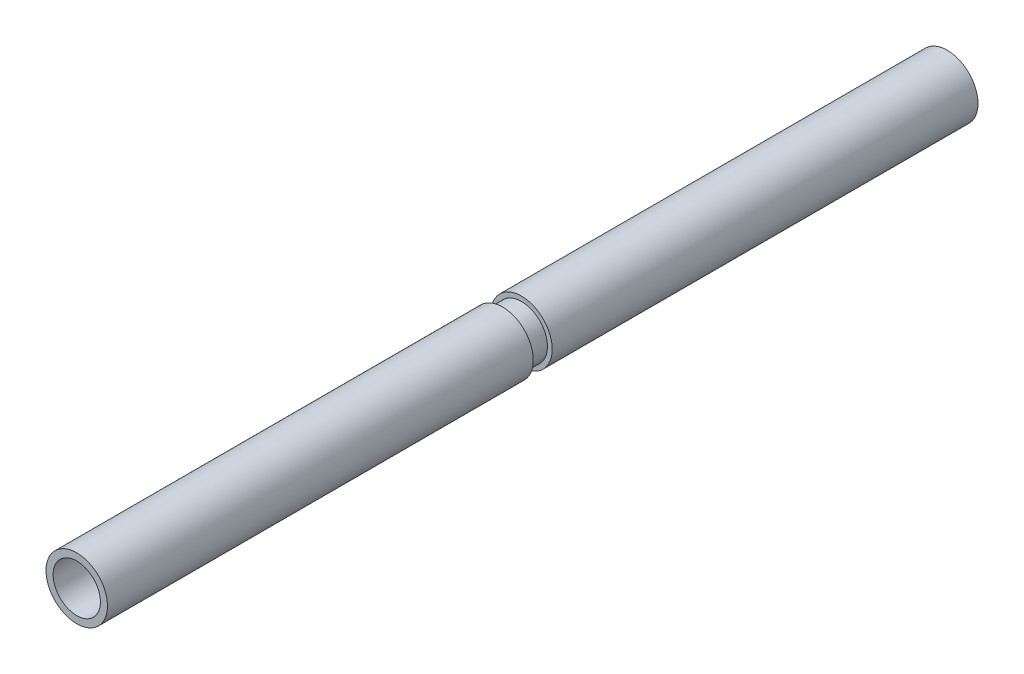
ISO-10303-21;
HEADER;
FILE_DESCRIPTION(('STEP AP214'),'2;1');
FILE_NAME('part.step','',(''),(''),'','','');
FILE_SCHEMA(('AUTOMOTIVE_DESIGN { 1 0 10303 214 1 1 1 1 }'));
ENDSEC;
DATA;
#1=APPLICATION_CONTEXT('core data for automotive mechanical design processes');
#2=APPLICATION_PROTOCOL_DEFINITION('international standard','automotive_design',2000,#1);
#3=PRODUCT_CONTEXT('',#1,'mechanical');
#4=PRODUCT('Part','Part','',(#3));
#5=PRODUCT_RELATED_PRODUCT_CATEGORY('part','',(#4));
#6=PRODUCT_DEFINITION_FORMATION('','',#4);
#7=PRODUCT_DEFINITION_CONTEXT('part definition',#1,'design');
#8=PRODUCT_DEFINITION('design','',#6,#7);
#9=PRODUCT_DEFINITION_SHAPE('','',#8);
#10=(LENGTH_UNIT() NAMED_UNIT(*) SI_UNIT(.MILLI.,.METRE.));
#11=(NAMED_UNIT(*) PLANE_ANGLE_UNIT() SI_UNIT($,.RADIAN.));
#12=(NAMED_UNIT(*) SI_UNIT($,.STERADIAN.) SOLID_ANGLE_UNIT());
#13=UNCERTAINTY_MEASURE_WITH_UNIT(LENGTH_MEASURE(1.E-05),#10,'distance_accuracy_value','');
#14=(GEOMETRIC_REPRESENTATION_CONTEXT(3) GLOBAL_UNCERTAINTY_ASSIGNED_CONTEXT((#13)) GLOBAL_UNIT_ASSIGNED_CONTEXT((#10,
#11,#12)) REPRESENTATION_CONTEXT('',''));
#15=CARTESIAN_POINT('',(0.,0.,0.));
#16=DIRECTION('',(0.,0.,1.));
#17=DIRECTION('',(1.,0.,0.));
#18=AXIS2_PLACEMENT_3D('',#15,#16,#17);
#19=CARTESIAN_POINT('',(0.,0.,90.));
#20=DIRECTION('',(0.,0.,-1.));
#21=DIRECTION('',(-1.,0.,0.));
#22=AXIS2_PLACEMENT_3D('',#19,#20,#21);
#23=CYLINDRICAL_SURFACE('',#22,6.5);
#24=CARTESIAN_POINT('',(0.,0.,90.));
#25=DIRECTION('',(0.,0.,1.));
#26=DIRECTION('',(1.,0.,0.));
#27=AXIS2_PLACEMENT_3D('',#24,#25,#26);
#28=CIRCLE('',#27,6.5);
#29=CARTESIAN_POINT('',(-6.5,0.,90.));
#30=VERTEX_POINT('',#29);
#31=EDGE_CURVE('E38',#30,#30,#28,.T.);
#32=CARTESIAN_POINT('',(0.,0.,0.));
#33=DIRECTION('',(0.,0.,1.));
#34=DIRECTION('',(1.,0.,0.));
#35=AXIS2_PLACEMENT_3D('',#32,#33,#34);
#36=CIRCLE('',#35,6.5);
#37=CARTESIAN_POINT('',(-6.5,0.,0.));
#38=VERTEX_POINT('',#37);
#39=EDGE_CURVE('E34',#38,#38,#36,.T.);
#40=CARTESIAN_POINT('',(-6.5,0.,90.));
#41=CARTESIAN_POINT('',(-6.5,0.,89.0625));
#42=CARTESIAN_POINT('',(-6.5,0.,88.125));
#43=CARTESIAN_POINT('',(-6.5,0.,86.25));
#44=CARTESIAN_POINT('',(-6.5,0.,85.3125));
#45=CARTESIAN_POINT('',(-6.5,0.,83.4375));
#46=CARTESIAN_POINT('',(-6.5,0.,82.5));
#47=CARTESIAN_POINT('',(-6.5,0.,80.625));
#48=CARTESIAN_POINT('',(-6.5,0.,79.6875));
#49=CARTESIAN_POINT('',(-6.5,0.,77.8125));
#50=CARTESIAN_POINT('',(-6.5,0.,76.875));
#51=CARTESIAN_POINT('',(-6.5,0.,75.));
#52=CARTESIAN_POINT('',(-6.5,0.,74.0625));
#53=CARTESIAN_POINT('',(-6.5,0.,72.1875));
#54=CARTESIAN_POINT('',(-6.5,0.,71.25));
#55=CARTESIAN_POINT('',(-6.5,0.,69.375));
#56=CARTESIAN_POINT('',(-6.5,0.,68.4375));
#57=CARTESIAN_POINT('',(-6.5,0.,66.5625));
#58=CARTESIAN_POINT('',(-6.5,0.,65.625));
#59=CARTESIAN_POINT('',(-6.5,0.,63.75));
#60=CARTESIAN_POINT('',(-6.5,0.,62.8125));
#61=CARTESIAN_POINT('',(-6.5,0.,60.9375));
#62=CARTESIAN_POINT('',(-6.5,0.,60.));
#63=CARTESIAN_POINT('',(-6.5,0.,58.125));
#64=CARTESIAN_POINT('',(-6.5,0.,57.1875));
#65=CARTESIAN_POINT('',(-6.5,0.,55.3125));
#66=CARTESIAN_POINT('',(-6.5,0.,54.375));
#67=CARTESIAN_POINT('',(-6.5,0.,52.5));
#68=CARTESIAN_POINT('',(-6.5,0.,51.5625));
#69=CARTESIAN_POINT('',(-6.5,0.,49.6875));
#70=CARTESIAN_POINT('',(-6.5,0.,48.75));
#71=CARTESIAN_POINT('',(-6.5,0.,46.875));
#72=CARTESIAN_POINT('',(-6.5,0.,45.9375));
#73=CARTESIAN_POINT('',(-6.5,0.,44.0625));
#74=CARTESIAN_POINT('',(-6.5,0.,43.125));
#75=CARTESIAN_POINT('',(-6.5,0.,41.25));
#76=CARTESIAN_POINT('',(-6.5,0.,40.3125));
#77=CARTESIAN_POINT('',(-6.5,0.,38.4375));
#78=CARTESIAN_POINT('',(-6.5,0.,37.5));
#79=CARTESIAN_POINT('',(-6.5,0.,35.625));
#80=CARTESIAN_POINT('',(-6.5,0.,34.6875));
#81=CARTESIAN_POINT('',(-6.5,0.,32.8125));
#82=CARTESIAN_POINT('',(-6.5,0.,31.875));
#83=CARTESIAN_POINT('',(-6.5,0.,30.));
#84=CARTESIAN_POINT('',(-6.5,0.,29.0625));
#85=CARTESIAN_POINT('',(-6.5,0.,27.1875));
#86=CARTESIAN_POINT('',(-6.5,0.,26.25));
#87=CARTESIAN_POINT('',(-6.5,0.,24.375));
#88=CARTESIAN_POINT('',(-6.5,0.,23.4375));
#89=CARTESIAN_POINT('',(-6.5,0.,21.5625));
#90=CARTESIAN_POINT('',(-6.5,0.,20.625));
#91=CARTESIAN_POINT('',(-6.5,0.,18.75));
#92=CARTESIAN_POINT('',(-6.5,0.,17.8125));
#93=CARTESIAN_POINT('',(-6.5,0.,15.9375));
#94=CARTESIAN_POINT('',(-6.5,0.,15.));
#95=CARTESIAN_POINT('',(-6.5,0.,13.125));
#96=CARTESIAN_POINT('',(-6.5,0.,12.1875));
#97=CARTESIAN_POINT('',(-6.5,0.,10.3125));
#98=CARTESIAN_POINT('',(-6.5,0.,9.37499999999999));
#99=CARTESIAN_POINT('',(-6.5,0.,7.49999999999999));
#100=CARTESIAN_POINT('',(-6.5,0.,6.56249999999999));
#101=CARTESIAN_POINT('',(-6.5,0.,4.68749999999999));
#102=CARTESIAN_POINT('',(-6.5,0.,3.74999999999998));
#103=CARTESIAN_POINT('',(-6.5,0.,1.87499999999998));
#104=CARTESIAN_POINT('',(-6.5,0.,0.937499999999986));
#105=CARTESIAN_POINT('',(-6.5,0.,0.));
#106=B_SPLINE_CURVE_WITH_KNOTS('',3,(#40,#41,#42,#43,#44,#45,#46,#47,#48,#49,#50,#51,#52,#53,
#54,#55,#56,#57,#58,#59,#60,#61,#62,#63,#64,#65,#66,#67,#68,#69,#70,#71,#72,#73,#74,#75,#76,#77,
#78,#79,#80,#81,#82,#83,#84,#85,#86,#87,#88,#89,#90,#91,#92,#93,#94,#95,#96,#97,#98,#99,#100,
#101,#102,#103,#104,#105),.UNSPECIFIED.,.F.,.F.,(4,2,2,2,2,2,2,2,2,2,2,2,2,2,2,2,2,2,2,2,2,2,2,
2,2,2,2,2,2,2,2,2,4),(0.,2.81250000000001,5.62500000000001,8.43750000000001,11.25,14.0625,
16.875,19.6875,22.5,25.3125,28.125,30.9375,33.75,36.5625,39.375,42.1875,45.,47.8125,50.625,
53.4375,56.25,59.0625,61.875,64.6875,67.5,70.3125,73.125,75.9375,78.75,81.5625,84.375,87.1875,
90.),.UNSPECIFIED.);
#107=EDGE_CURVE('BSEAM31',#30,#38,#106,.T.);
#108=ORIENTED_EDGE('',*,*,#31,.F.);
#109=ORIENTED_EDGE('',*,*,#39,.T.);
#110=ORIENTED_EDGE('',*,*,#107,.T.);
#111=ORIENTED_EDGE('',*,*,#107,.F.);
#112=EDGE_LOOP('',(#108,#110,#109,#111));
#113=FACE_BOUND('',#112,.T.);
#114=ADVANCED_FACE('F31',(#113),#23,.T.);
#115=CARTESIAN_POINT('',(0.,0.,90.));
#116=DIRECTION('',(0.,0.,1.));
#117=DIRECTION('',(1.,0.,0.));
#118=AXIS2_PLACEMENT_3D('',#115,#116,#117);
#119=PLANE('',#118);
#120=CARTESIAN_POINT('',(0.,0.,90.));
#121=DIRECTION('',(0.,0.,1.));
#122=DIRECTION('',(1.,0.,0.));
#123=AXIS2_PLACEMENT_3D('',#120,#121,#122);
#124=CIRCLE('',#123,5.);
#125=CARTESIAN_POINT('',(-5.,0.,90.));
#126=VERTEX_POINT('',#125);
#127=EDGE_CURVE('E56',#126,#126,#124,.T.);
#128=ORIENTED_EDGE('',*,*,#127,.F.);
#129=EDGE_LOOP('',(#128));
#130=FACE_BOUND('',#129,.T.);
#131=ORIENTED_EDGE('',*,*,#31,.T.);
#132=EDGE_LOOP('',(#131));
#133=FACE_BOUND('',#132,.T.);
#134=ADVANCED_FACE('F62',(#130,#133),#119,.T.);
#135=CARTESIAN_POINT('',(0.,0.,0.));
#136=DIRECTION('',(0.,0.,1.));
#137=DIRECTION('',(1.,0.,0.));
#138=AXIS2_PLACEMENT_3D('',#135,#136,#137);
#139=PLANE('',#138);
#140=CARTESIAN_POINT('',(0.,0.,0.));
#141=DIRECTION('',(0.,0.,-1.));
#142=DIRECTION('',(-1.,0.,0.));
#143=AXIS2_PLACEMENT_3D('',#140,#141,#142);
#144=CIRCLE('',#143,5.5);
#145=CARTESIAN_POINT('',(-5.5,0.,0.));
#146=VERTEX_POINT('',#145);
#147=EDGE_CURVE('E10',#146,#146,#144,.T.);
#148=ORIENTED_EDGE('',*,*,#147,.F.);
#149=EDGE_LOOP('',(#148));
#150=FACE_BOUND('',#149,.T.);
#151=ORIENTED_EDGE('',*,*,#39,.F.);
#152=EDGE_LOOP('',(#151));
#153=FACE_BOUND('',#152,.T.);
#154=ADVANCED_FACE('F65',(#150,#153),#139,.F.);
#155=CARTESIAN_POINT('',(0.,0.,-4.));
#156=DIRECTION('',(0.,0.,1.));
#157=DIRECTION('',(1.,0.,0.));
#158=AXIS2_PLACEMENT_3D('',#155,#156,#157);
#159=CYLINDRICAL_SURFACE('',#158,5.5);
#160=CARTESIAN_POINT('',(0.,0.,-4.));
#161=DIRECTION('',(0.,0.,-1.));
#162=DIRECTION('',(-1.,0.,0.));
#163=AXIS2_PLACEMENT_3D('',#160,#161,#162);
#164=CIRCLE('',#163,5.5);
#165=CARTESIAN_POINT('',(-5.5,0.,-4.));
#166=VERTEX_POINT('',#165);
#167=EDGE_CURVE('E44',#166,#166,#164,.T.);
#168=ORIENTED_EDGE('',*,*,#167,.F.);
#169=EDGE_LOOP('',(#168));
#170=FACE_BOUND('',#169,.T.);
#171=ORIENTED_EDGE('',*,*,#147,.T.);
#172=EDGE_LOOP('',(#171));
#173=FACE_BOUND('',#172,.T.);
#174=ADVANCED_FACE('F75',(#170,#173),#159,.T.);
#175=CARTESIAN_POINT('',(0.,0.,-94.));
#176=DIRECTION('',(0.,0.,1.));
#177=DIRECTION('',(1.,0.,0.));
#178=AXIS2_PLACEMENT_3D('',#175,#176,#177);
#179=CYLINDRICAL_SURFACE('',#178,6.5);
#180=CARTESIAN_POINT('',(0.,0.,-94.));
#181=DIRECTION('',(0.,0.,-1.));
#182=DIRECTION('',(-1.,0.,0.));
#183=AXIS2_PLACEMENT_3D('',#180,#181,#182);
#184=CIRCLE('',#183,6.5);
#185=CARTESIAN_POINT('',(6.5,0.,-94.));
#186=VERTEX_POINT('',#185);
#187=EDGE_CURVE('E47',#186,#186,#184,.T.);
#188=CARTESIAN_POINT('',(0.,0.,-4.));
#189=DIRECTION('',(0.,0.,-1.));
#190=DIRECTION('',(-1.,0.,0.));
#191=AXIS2_PLACEMENT_3D('',#188,#189,#190);
#192=CIRCLE('',#191,6.5);
#193=CARTESIAN_POINT('',(6.5,0.,-3.99999999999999));
#194=VERTEX_POINT('',#193);
#195=EDGE_CURVE('E48',#194,#194,#192,.T.);
#196=CARTESIAN_POINT('',(6.5,0.,-94.));
#197=CARTESIAN_POINT('',(6.5,0.,-93.0625));
#198=CARTESIAN_POINT('',(6.5,0.,-92.125));
#199=CARTESIAN_POINT('',(6.5,0.,-90.25));
#200=CARTESIAN_POINT('',(6.5,0.,-89.3125));
#201=CARTESIAN_POINT('',(6.5,0.,-87.4375));
#202=CARTESIAN_POINT('',(6.5,0.,-86.5));
#203=CARTESIAN_POINT('',(6.5,0.,-84.625));
#204=CARTESIAN_POINT('',(6.5,0.,-83.6875));
#205=CARTESIAN_POINT('',(6.5,0.,-81.8125));
#206=CARTESIAN_POINT('',(6.5,0.,-80.875));
#207=CARTESIAN_POINT('',(6.5,0.,-79.));
#208=CARTESIAN_POINT('',(6.5,0.,-78.0625));
#209=CARTESIAN_POINT('',(6.5,0.,-76.1875));
#210=CARTESIAN_POINT('',(6.5,0.,-75.25));
#211=CARTESIAN_POINT('',(6.5,0.,-73.375));
#212=CARTESIAN_POINT('',(6.5,0.,-72.4375));
#213=CARTESIAN_POINT('',(6.5,0.,-70.5625));
#214=CARTESIAN_POINT('',(6.5,0.,-69.625));
#215=CARTESIAN_POINT('',(6.5,0.,-67.75));
#216=CARTESIAN_POINT('',(6.5,0.,-66.8125));
#217=CARTESIAN_POINT('',(6.5,0.,-64.9375));
#218=CARTESIAN_POINT('',(6.5,0.,-64.));
#219=CARTESIAN_POINT('',(6.5,0.,-62.125));
#220=CARTESIAN_POINT('',(6.5,0.,-61.1875));
#221=CARTESIAN_POINT('',(6.5,0.,-59.3125));
#222=CARTESIAN_POINT('',(6.5,0.,-58.375));
#223=CARTESIAN_POINT('',(6.5,0.,-56.5));
#224=CARTESIAN_POINT('',(6.5,0.,-55.5625));
#225=CARTESIAN_POINT('',(6.5,0.,-53.6875));
#226=CARTESIAN_POINT('',(6.5,0.,-52.75));
#227=CARTESIAN_POINT('',(6.5,0.,-50.875));
#228=CARTESIAN_POINT('',(6.5,0.,-49.9375));
#229=CARTESIAN_POINT('',(6.5,0.,-48.0625));
#230=CARTESIAN_POINT('',(6.5,0.,-47.125));
#231=CARTESIAN_POINT('',(6.5,0.,-45.25));
#232=CARTESIAN_POINT('',(6.5,0.,-44.3125));
#233=CARTESIAN_POINT('',(6.5,0.,-42.4375));
#234=CARTESIAN_POINT('',(6.5,0.,-41.5));
#235=CARTESIAN_POINT('',(6.5,0.,-39.625));
#236=CARTESIAN_POINT('',(6.5,0.,-38.6875));
#237=CARTESIAN_POINT('',(6.5,0.,-36.8125));
#238=CARTESIAN_POINT('',(6.5,0.,-35.875));
#239=CARTESIAN_POINT('',(6.5,0.,-34.));
#240=CARTESIAN_POINT('',(6.5,0.,-33.0625));
#241=CARTESIAN_POINT('',(6.5,0.,-31.1875));
#242=CARTESIAN_POINT('',(6.5,0.,-30.25));
#243=CARTESIAN_POINT('',(6.5,0.,-28.375));
#244=CARTESIAN_POINT('',(6.5,0.,-27.4375));
#245=CARTESIAN_POINT('',(6.5,0.,-25.5625));
#246=CARTESIAN_POINT('',(6.5,0.,-24.625));
#247=CARTESIAN_POINT('',(6.5,0.,-22.75));
#248=CARTESIAN_POINT('',(6.5,0.,-21.8125));
#249=CARTESIAN_POINT('',(6.5,0.,-19.9375));
#250=CARTESIAN_POINT('',(6.5,0.,-19.));
#251=CARTESIAN_POINT('',(6.5,0.,-17.125));
#252=CARTESIAN_POINT('',(6.5,0.,-16.1875));
#253=CARTESIAN_POINT('',(6.5,0.,-14.3125));
#254=CARTESIAN_POINT('',(6.5,0.,-13.375));
#255=CARTESIAN_POINT('',(6.5,0.,-11.5));
#256=CARTESIAN_POINT('',(6.5,0.,-10.5625));
#257=CARTESIAN_POINT('',(6.5,0.,-8.68749999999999));
#258=CARTESIAN_POINT('',(6.5,0.,-7.74999999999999));
#259=CARTESIAN_POINT('',(6.5,0.,-5.87499999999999));
#260=CARTESIAN_POINT('',(6.5,0.,-4.93749999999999));
#261=CARTESIAN_POINT('',(6.5,0.,-3.99999999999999));
#262=B_SPLINE_CURVE_WITH_KNOTS('',3,(#196,#197,#198,#199,#200,#201,#202,#203,#204,#205,#206,
#207,#208,#209,#210,#211,#212,#213,#214,#215,#216,#217,#218,#219,#220,#221,#222,#223,#224,#225,
#226,#227,#228,#229,#230,#231,#232,#233,#234,#235,#236,#237,#238,#239,#240,#241,#242,#243,#244,
#245,#246,#247,#248,#249,#250,#251,#252,#253,#254,#255,#256,#257,#258,#259,#260,#261),
.UNSPECIFIED.,.F.,.F.,(4,2,2,2,2,2,2,2,2,2,2,2,2,2,2,2,2,2,2,2,2,2,2,2,2,2,2,2,2,2,2,2,4),(0.,
2.81250000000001,5.62500000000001,8.43750000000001,11.25,14.0625,16.875,19.6875,22.5,25.3125,
28.125,30.9375,33.75,36.5625,39.375,42.1875,45.,47.8125,50.625,53.4375,56.25,59.0625,61.875,
64.6875,67.5,70.3125,73.125,75.9375,78.75,81.5625,84.375,87.1875,90.),.UNSPECIFIED.);
#263=EDGE_CURVE('BSEAM80',#186,#194,#262,.T.);
#264=ORIENTED_EDGE('',*,*,#187,.F.);
#265=ORIENTED_EDGE('',*,*,#195,.T.);
#266=ORIENTED_EDGE('',*,*,#263,.T.);
#267=ORIENTED_EDGE('',*,*,#263,.F.);
#268=EDGE_LOOP('',(#264,#266,#265,#267));
#269=FACE_BOUND('',#268,.T.);
#270=ADVANCED_FACE('F80',(#269),#179,.T.);
#271=CARTESIAN_POINT('',(0.,0.,-94.));
#272=DIRECTION('',(0.,0.,-1.));
#273=DIRECTION('',(-1.,0.,0.));
#274=AXIS2_PLACEMENT_3D('',#271,#272,#273);
#275=PLANE('',#274);
#276=CARTESIAN_POINT('',(0.,0.,-94.));
#277=DIRECTION('',(0.,0.,-1.));
#278=DIRECTION('',(-1.,0.,0.));
#279=AXIS2_PLACEMENT_3D('',#276,#277,#278);
#280=CIRCLE('',#279,5.);
#281=CARTESIAN_POINT('',(-5.,0.,-94.));
#282=VERTEX_POINT('',#281);
#283=EDGE_CURVE('E51',#282,#282,#280,.T.);
#284=ORIENTED_EDGE('',*,*,#283,.F.);
#285=EDGE_LOOP('',(#284));
#286=FACE_BOUND('',#285,.T.);
#287=ORIENTED_EDGE('',*,*,#187,.T.);
#288=EDGE_LOOP('',(#287));
#289=FACE_BOUND('',#288,.T.);
#290=ADVANCED_FACE('F86',(#286,#289),#275,.T.);
#291=CARTESIAN_POINT('',(0.,0.,-4.));
#292=DIRECTION('',(0.,0.,-1.));
#293=DIRECTION('',(-1.,0.,0.));
#294=AXIS2_PLACEMENT_3D('',#291,#292,#293);
#295=PLANE('',#294);
#296=ORIENTED_EDGE('',*,*,#167,.T.);
#297=EDGE_LOOP('',(#296));
#298=FACE_BOUND('',#297,.T.);
#299=ORIENTED_EDGE('',*,*,#195,.F.);
#300=EDGE_LOOP('',(#299));
#301=FACE_BOUND('',#300,.T.);
#302=ADVANCED_FACE('F88',(#298,#301),#295,.F.);
#303=CARTESIAN_POINT('',(0.,0.,-4.));
#304=DIRECTION('',(0.,0.,-1.));
#305=DIRECTION('',(-1.,0.,0.));
#306=AXIS2_PLACEMENT_3D('',#303,#304,#305);
#307=CYLINDRICAL_SURFACE('',#306,5.);
#308=CARTESIAN_POINT('',(-5.,0.,-94.));
#309=CARTESIAN_POINT('',(-5.,0.,-92.0833333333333));
#310=CARTESIAN_POINT('',(-5.,0.,-90.1666666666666));
#311=CARTESIAN_POINT('',(-5.,0.,-86.3333333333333));
#312=CARTESIAN_POINT('',(-5.,0.,-84.4166666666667));
#313=CARTESIAN_POINT('',(-5.,0.,-80.5833333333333));
#314=CARTESIAN_POINT('',(-5.,0.,-78.6666666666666));
#315=CARTESIAN_POINT('',(-5.,0.,-74.8333333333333));
#316=CARTESIAN_POINT('',(-5.,0.,-72.9166666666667));
#317=CARTESIAN_POINT('',(-5.,0.,-69.0833333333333));
#318=CARTESIAN_POINT('',(-5.,0.,-67.1666666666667));
#319=CARTESIAN_POINT('',(-5.,0.,-63.3333333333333));
#320=CARTESIAN_POINT('',(-5.,0.,-61.4166666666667));
#321=CARTESIAN_POINT('',(-5.,0.,-57.5833333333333));
#322=CARTESIAN_POINT('',(-5.,0.,-55.6666666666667));
#323=CARTESIAN_POINT('',(-5.,0.,-51.8333333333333));
#324=CARTESIAN_POINT('',(-5.,0.,-49.9166666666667));
#325=CARTESIAN_POINT('',(-5.,0.,-46.0833333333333));
#326=CARTESIAN_POINT('',(-5.,0.,-44.1666666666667));
#327=CARTESIAN_POINT('',(-5.,0.,-40.3333333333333));
#328=CARTESIAN_POINT('',(-5.,0.,-38.4166666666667));
#329=CARTESIAN_POINT('',(-5.,0.,-34.5833333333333));
#330=CARTESIAN_POINT('',(-5.,0.,-32.6666666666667));
#331=CARTESIAN_POINT('',(-5.,0.,-28.8333333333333));
#332=CARTESIAN_POINT('',(-5.,0.,-26.9166666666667));
#333=CARTESIAN_POINT('',(-5.,0.,-23.0833333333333));
#334=CARTESIAN_POINT('',(-5.,0.,-21.1666666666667));
#335=CARTESIAN_POINT('',(-5.,0.,-17.3333333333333));
#336=CARTESIAN_POINT('',(-5.,0.,-15.4166666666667));
#337=CARTESIAN_POINT('',(-5.,0.,-11.5833333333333));
#338=CARTESIAN_POINT('',(-5.,0.,-9.66666666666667));
#339=CARTESIAN_POINT('',(-5.,0.,-5.83333333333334));
#340=CARTESIAN_POINT('',(-5.,0.,-3.91666666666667));
#341=CARTESIAN_POINT('',(-5.,0.,-0.0833333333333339));
#342=CARTESIAN_POINT('',(-5.,0.,1.83333333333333));
#343=CARTESIAN_POINT('',(-5.,0.,5.66666666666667));
#344=CARTESIAN_POINT('',(-5.,0.,7.58333333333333));
#345=CARTESIAN_POINT('',(-5.,0.,11.4166666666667));
#346=CARTESIAN_POINT('',(-5.,0.,13.3333333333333));
#347=CARTESIAN_POINT('',(-5.,0.,17.1666666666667));
#348=CARTESIAN_POINT('',(-5.,0.,19.0833333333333));
#349=CARTESIAN_POINT('',(-5.,0.,22.9166666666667));
#350=CARTESIAN_POINT('',(-5.,0.,24.8333333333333));
#351=CARTESIAN_POINT('',(-5.,0.,28.6666666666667));
#352=CARTESIAN_POINT('',(-5.,0.,30.5833333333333));
#353=CARTESIAN_POINT('',(-5.,0.,34.4166666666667));
#354=CARTESIAN_POINT('',(-5.,0.,36.3333333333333));
#355=CARTESIAN_POINT('',(-5.,0.,40.1666666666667));
#356=CARTESIAN_POINT('',(-5.,0.,42.0833333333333));
#357=CARTESIAN_POINT('',(-5.,0.,45.9166666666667));
#358=CARTESIAN_POINT('',(-5.,0.,47.8333333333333));
#359=CARTESIAN_POINT('',(-5.,0.,51.6666666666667));
#360=CARTESIAN_POINT('',(-5.,0.,53.5833333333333));
#361=CARTESIAN_POINT('',(-5.,0.,57.4166666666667));
#362=CARTESIAN_POINT('',(-5.,0.,59.3333333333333));
#363=CARTESIAN_POINT('',(-5.,0.,63.1666666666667));
#364=CARTESIAN_POINT('',(-5.,0.,65.0833333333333));
#365=CARTESIAN_POINT('',(-5.,0.,68.9166666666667));
#366=CARTESIAN_POINT('',(-5.,0.,70.8333333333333));
#367=CARTESIAN_POINT('',(-5.,0.,74.6666666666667));
#368=CARTESIAN_POINT('',(-5.,0.,76.5833333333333));
#369=CARTESIAN_POINT('',(-5.,0.,80.4166666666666));
#370=CARTESIAN_POINT('',(-5.,0.,82.3333333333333));
#371=CARTESIAN_POINT('',(-5.,0.,86.1666666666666));
#372=CARTESIAN_POINT('',(-5.,0.,88.0833333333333));
#373=CARTESIAN_POINT('',(-5.,0.,90.));
#374=B_SPLINE_CURVE_WITH_KNOTS('',3,(#308,#309,#310,#311,#312,#313,#314,#315,#316,#317,#318,
#319,#320,#321,#322,#323,#324,#325,#326,#327,#328,#329,#330,#331,#332,#333,#334,#335,#336,#337,
#338,#339,#340,#341,#342,#343,#344,#345,#346,#347,#348,#349,#350,#351,#352,#353,#354,#355,#356,
#357,#358,#359,#360,#361,#362,#363,#364,#365,#366,#367,#368,#369,#370,#371,#372,#373),
.UNSPECIFIED.,.F.,.F.,(4,2,2,2,2,2,2,2,2,2,2,2,2,2,2,2,2,2,2,2,2,2,2,2,2,2,2,2,2,2,2,2,4),(0.,
5.75000000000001,11.5,17.25,23.,28.75,34.5,40.25,46.,51.75,57.5,63.25,69.,74.75,80.5,86.25,92.,
97.75,103.5,109.25,115.,120.75,126.5,132.25,138.,143.75,149.5,155.25,161.,166.75,172.5,178.25,
184.),.UNSPECIFIED.);
#375=EDGE_CURVE('BSEAM60',#282,#126,#374,.T.);
#376=ORIENTED_EDGE('',*,*,#283,.T.);
#377=ORIENTED_EDGE('',*,*,#127,.T.);
#378=ORIENTED_EDGE('',*,*,#375,.T.);
#379=ORIENTED_EDGE('',*,*,#375,.F.);
#380=EDGE_LOOP('',(#376,#378,#377,#379));
#381=FACE_BOUND('',#380,.T.);
#382=ADVANCED_FACE('F60',(#381),#307,.F.);
#383=CLOSED_SHELL('',(#114,#134,#154,#174,#270,#290,#302,#382));
#384=MANIFOLD_SOLID_BREP('B2',#383);
#385=ADVANCED_BREP_SHAPE_REPRESENTATION('',(#18,#384),#14);
#386=SHAPE_DEFINITION_REPRESENTATION(#9,#385);
ENDSEC;
END-ISO-10303-21;
